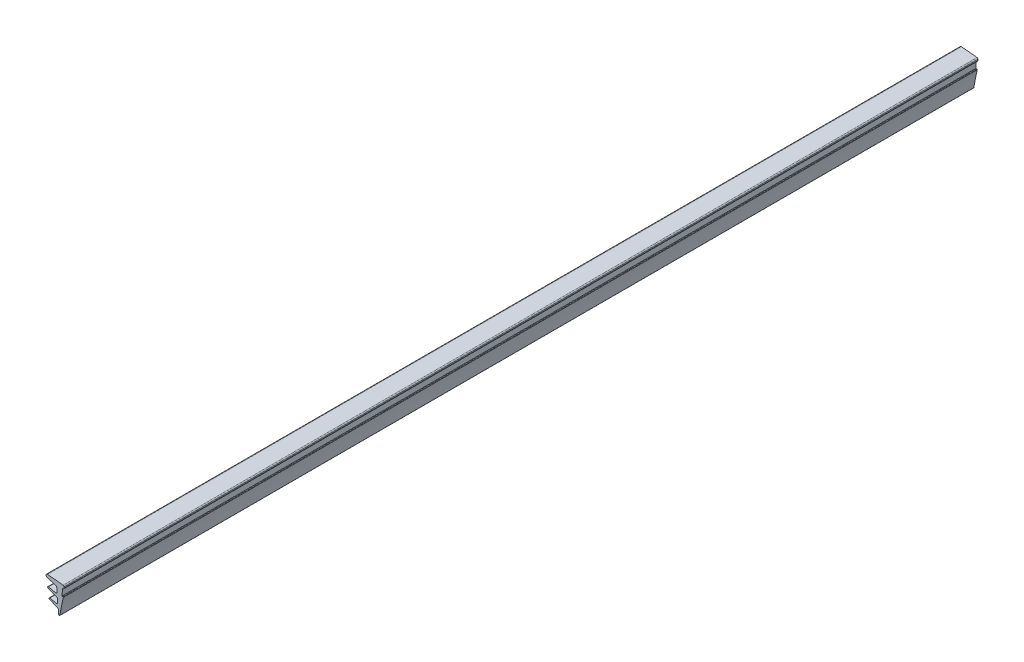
from build123d import *


with BuildPart() as part:
    # Sweep 1: sweep along a path in Sketch 2
    with BuildLine(Plane(origin=(0, 0, 0), x_dir=(1, 0, 0), z_dir=(0, 1, 0))) as sweep_1_path:
        Line((0, 0), (0, 300))
    # Sketch 1 → Sweep 1 (sweep)
    with BuildSketch(Plane.XY):
        with BuildLine():
            Line((2.676070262, 2.335427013), (2.693071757, 2.673145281))
            ThreePointArc((2.693071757, 2.673145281), (2.6086262, 2.919250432), (2.377668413, 3.039072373))
            Line((2.377668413, 3.039072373), (-2.740417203, 3.540904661))
            ThreePointArc((-2.740417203, 3.540904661), (-3.224691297, 3.18568852), (-2.924577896, 2.665465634))
            Line((-2.924577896, 2.665465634), (0.116914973, 1.667856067))
            ThreePointArc((0.116914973, 1.667856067), (0.235603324, 1.584732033), (0.2882436, 1.449730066))
            Line((0.2882436, 1.449730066), (0.398791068, 0.031075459))
            ThreePointArc((0.398791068, 0.031075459), (0.258592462, -0.305171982), (-0.096105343, -0.388283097))
            Line((-0.096105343, -0.388283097), (-2.386166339, 0.178538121))
            ThreePointArc((-2.386166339, 0.178538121), (-2.684216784, 0.012433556), (-2.538950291, -0.296309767))
            Line((-2.538950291, -0.296309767), (0.235799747, -1.404413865))
            ThreePointArc((0.235799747, -1.404413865), (0.444866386, -1.534104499), (0.538485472, -1.761621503))
            Line((0.538485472, -1.761621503), (0.622634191, -2.841501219))
            ThreePointArc((0.622634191, -2.841501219), (0.482435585, -3.177748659), (0.12773778, -3.260859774))
            Line((0.12773778, -3.260859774), (-1.920966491, -2.753777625))
            ThreePointArc((-1.920966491, -2.753777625), (-2.21865717, -2.918772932), (-2.075912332, -3.227750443))
            Line((-2.075912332, -3.227750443), (0.515751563, -4.290878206))
            ThreePointArc((0.515751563, -4.290878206), (0.724818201, -4.420568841), (0.818437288, -4.648085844))
            Line((0.818437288, -4.648085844), (0.926299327, -6.032278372))
            ThreePointArc((0.926299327, -6.032278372), (1.089157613, -6.213374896), (1.306199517, -6.102868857))
            ThreePointArc((1.306199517, -6.102868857), (1.851805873, -3.23923827), (2.467473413, -0.389848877))
            ThreePointArc((2.467473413, -0.389848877), (2.44024483, -0.313847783), (2.36575351, -0.28272536))
            Line((2.36575351, -0.28272536), (2.166464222, -0.286662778))
            ThreePointArc((2.166464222, -0.286662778), (2.093285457, -0.256896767), (2.064545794, -0.183308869))
            Line((2.064545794, -0.183308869), (2.130243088, 1.763080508))
            ThreePointArc((2.130243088, 1.763080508), (2.194183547, 1.921783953), (2.34520814, 2.002199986))
            Line((2.34520814, 2.002199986), (2.375362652, 2.006450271))
            ThreePointArc((2.375362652, 2.006450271), (2.584850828, 2.116885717), (2.676070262, 2.335427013))
        make_face()
    sweep(path=sweep_1_path.line)


solid = part.part
